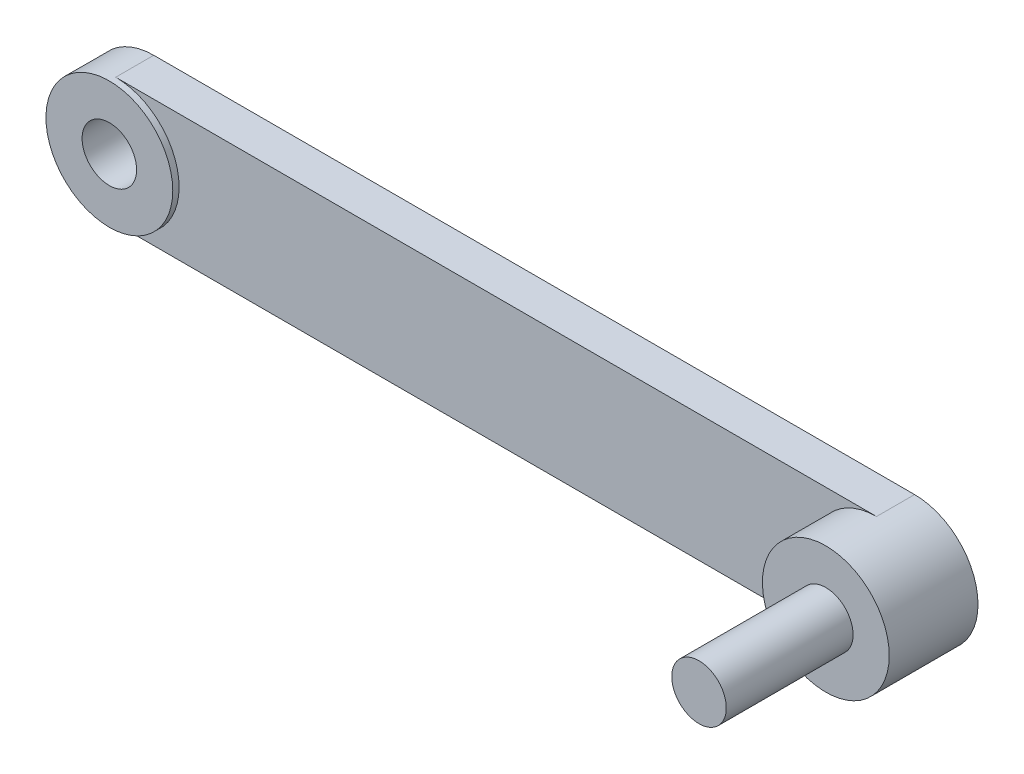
ISO-10303-21;
HEADER;
FILE_DESCRIPTION(('STEP AP214'),'2;1');
FILE_NAME('part.step','',(''),(''),'','','');
FILE_SCHEMA(('AUTOMOTIVE_DESIGN { 1 0 10303 214 1 1 1 1 }'));
ENDSEC;
DATA;
#1=APPLICATION_CONTEXT('core data for automotive mechanical design processes');
#2=APPLICATION_PROTOCOL_DEFINITION('international standard','automotive_design',2000,#1);
#3=PRODUCT_CONTEXT('',#1,'mechanical');
#4=PRODUCT('Part','Part','',(#3));
#5=PRODUCT_RELATED_PRODUCT_CATEGORY('part','',(#4));
#6=PRODUCT_DEFINITION_FORMATION('','',#4);
#7=PRODUCT_DEFINITION_CONTEXT('part definition',#1,'design');
#8=PRODUCT_DEFINITION('design','',#6,#7);
#9=PRODUCT_DEFINITION_SHAPE('','',#8);
#10=(LENGTH_UNIT() NAMED_UNIT(*) SI_UNIT(.MILLI.,.METRE.));
#11=(NAMED_UNIT(*) PLANE_ANGLE_UNIT() SI_UNIT($,.RADIAN.));
#12=(NAMED_UNIT(*) SI_UNIT($,.STERADIAN.) SOLID_ANGLE_UNIT());
#13=UNCERTAINTY_MEASURE_WITH_UNIT(LENGTH_MEASURE(1.E-05),#10,'distance_accuracy_value','');
#14=(GEOMETRIC_REPRESENTATION_CONTEXT(3) GLOBAL_UNCERTAINTY_ASSIGNED_CONTEXT((#13)) GLOBAL_UNIT_ASSIGNED_CONTEXT((#10,
#11,#12)) REPRESENTATION_CONTEXT('',''));
#15=CARTESIAN_POINT('',(0.,0.,0.));
#16=DIRECTION('',(0.,0.,1.));
#17=DIRECTION('',(1.,0.,0.));
#18=AXIS2_PLACEMENT_3D('',#15,#16,#17);
#19=CARTESIAN_POINT('',(0.,0.,3.));
#20=DIRECTION('',(0.,0.,1.));
#21=DIRECTION('',(1.,0.,0.));
#22=AXIS2_PLACEMENT_3D('',#19,#20,#21);
#23=PLANE('',#22);
#24=DIRECTION('',(1.,0.,0.));
#25=VECTOR('',#24,1.);
#26=CARTESIAN_POINT('',(0.,-5.,3.));
#27=LINE('',#26,#25);
#28=CARTESIAN_POINT('',(0.,-5.,3.));
#29=VERTEX_POINT('',#28);
#30=CARTESIAN_POINT('',(60.,-5.,3.));
#31=VERTEX_POINT('',#30);
#32=EDGE_CURVE('E52',#29,#31,#27,.T.);
#33=ORIENTED_EDGE('',*,*,#32,.T.);
#34=CARTESIAN_POINT('',(60.,0.,3.));
#35=DIRECTION('',(0.,0.,1.));
#36=DIRECTION('',(1.,0.,0.));
#37=AXIS2_PLACEMENT_3D('',#34,#35,#36);
#38=CIRCLE('',#37,5.);
#39=CARTESIAN_POINT('',(60.,5.,3.));
#40=VERTEX_POINT('',#39);
#41=EDGE_CURVE('E116',#40,#31,#38,.T.);
#42=ORIENTED_EDGE('',*,*,#41,.F.);
#43=DIRECTION('',(-1.,0.,0.));
#44=VECTOR('',#43,1.);
#45=CARTESIAN_POINT('',(0.,5.,3.));
#46=LINE('',#45,#44);
#47=CARTESIAN_POINT('',(0.,5.,3.));
#48=VERTEX_POINT('',#47);
#49=EDGE_CURVE('E91',#40,#48,#46,.T.);
#50=ORIENTED_EDGE('',*,*,#49,.T.);
#51=CARTESIAN_POINT('',(0.,0.,3.));
#52=DIRECTION('',(0.,0.,1.));
#53=DIRECTION('',(1.,0.,0.));
#54=AXIS2_PLACEMENT_3D('',#51,#52,#53);
#55=CIRCLE('',#54,5.);
#56=EDGE_CURVE('E44',#29,#48,#55,.T.);
#57=ORIENTED_EDGE('',*,*,#56,.F.);
#58=EDGE_LOOP('',(#33,#42,#50,#57));
#59=FACE_BOUND('',#58,.T.);
#60=ADVANCED_FACE('F35',(#59),#23,.T.);
#61=CARTESIAN_POINT('',(0.,0.,0.));
#62=DIRECTION('',(0.,0.,1.));
#63=DIRECTION('',(1.,0.,0.));
#64=AXIS2_PLACEMENT_3D('',#61,#62,#63);
#65=PLANE('',#64);
#66=CARTESIAN_POINT('',(0.,0.,0.));
#67=DIRECTION('',(0.,0.,1.));
#68=DIRECTION('',(1.,0.,0.));
#69=AXIS2_PLACEMENT_3D('',#66,#67,#68);
#70=CIRCLE('',#69,5.);
#71=CARTESIAN_POINT('',(0.,5.,0.));
#72=VERTEX_POINT('',#71);
#73=CARTESIAN_POINT('',(0.,-5.,0.));
#74=VERTEX_POINT('',#73);
#75=EDGE_CURVE('E90',#72,#74,#70,.T.);
#76=ORIENTED_EDGE('',*,*,#75,.F.);
#77=DIRECTION('',(-1.,0.,0.));
#78=VECTOR('',#77,1.);
#79=CARTESIAN_POINT('',(0.,5.,0.));
#80=LINE('',#79,#78);
#81=CARTESIAN_POINT('',(60.,5.,0.));
#82=VERTEX_POINT('',#81);
#83=EDGE_CURVE('E75',#82,#72,#80,.T.);
#84=ORIENTED_EDGE('',*,*,#83,.F.);
#85=CARTESIAN_POINT('',(60.,0.,0.));
#86=DIRECTION('',(0.,0.,1.));
#87=DIRECTION('',(1.,0.,0.));
#88=AXIS2_PLACEMENT_3D('',#85,#86,#87);
#89=CIRCLE('',#88,5.);
#90=CARTESIAN_POINT('',(60.,-5.,0.));
#91=VERTEX_POINT('',#90);
#92=EDGE_CURVE('E69',#91,#82,#89,.T.);
#93=ORIENTED_EDGE('',*,*,#92,.F.);
#94=DIRECTION('',(1.,0.,0.));
#95=VECTOR('',#94,1.);
#96=CARTESIAN_POINT('',(0.,-5.,0.));
#97=LINE('',#96,#95);
#98=EDGE_CURVE('E95',#74,#91,#97,.T.);
#99=ORIENTED_EDGE('',*,*,#98,.F.);
#100=EDGE_LOOP('',(#76,#84,#93,#99));
#101=FACE_BOUND('',#100,.T.);
#102=CARTESIAN_POINT('',(0.,0.,0.));
#103=DIRECTION('',(0.,0.,1.));
#104=DIRECTION('',(1.,0.,0.));
#105=AXIS2_PLACEMENT_3D('',#102,#103,#104);
#106=CIRCLE('',#105,2.15);
#107=CARTESIAN_POINT('',(2.15,0.,0.));
#108=VERTEX_POINT('',#107);
#109=EDGE_CURVE('E97',#108,#108,#106,.T.);
#110=ORIENTED_EDGE('',*,*,#109,.T.);
#111=EDGE_LOOP('',(#110));
#112=FACE_BOUND('',#111,.T.);
#113=ADVANCED_FACE('F93',(#101,#112),#65,.F.);
#114=CARTESIAN_POINT('',(0.,0.,3.));
#115=DIRECTION('',(0.,0.,-1.));
#116=DIRECTION('',(-1.,0.,0.));
#117=AXIS2_PLACEMENT_3D('',#114,#115,#116);
#118=CYLINDRICAL_SURFACE('',#117,5.);
#119=ORIENTED_EDGE('',*,*,#75,.T.);
#120=DIRECTION('',(0.,0.,-1.));
#121=VECTOR('',#120,1.);
#122=CARTESIAN_POINT('',(0.,-5.,3.));
#123=LINE('',#122,#121);
#124=EDGE_CURVE('E109',#29,#74,#123,.T.);
#125=ORIENTED_EDGE('',*,*,#124,.F.);
#126=ORIENTED_EDGE('',*,*,#56,.T.);
#127=DIRECTION('',(0.,0.,-1.));
#128=VECTOR('',#127,1.);
#129=CARTESIAN_POINT('',(0.,5.,3.));
#130=LINE('',#129,#128);
#131=EDGE_CURVE('E79',#48,#72,#130,.T.);
#132=ORIENTED_EDGE('',*,*,#131,.T.);
#133=EDGE_LOOP('',(#119,#125,#126,#132));
#134=FACE_BOUND('',#133,.T.);
#135=CARTESIAN_POINT('',(0.,0.,3.5));
#136=DIRECTION('',(0.,0.,1.));
#137=DIRECTION('',(1.,0.,0.));
#138=AXIS2_PLACEMENT_3D('',#135,#136,#137);
#139=CIRCLE('',#138,5.);
#140=CARTESIAN_POINT('',(5.,0.,3.5));
#141=VERTEX_POINT('',#140);
#142=EDGE_CURVE('E101',#141,#141,#139,.T.);
#143=ORIENTED_EDGE('',*,*,#142,.F.);
#144=EDGE_LOOP('',(#143));
#145=FACE_BOUND('',#144,.T.);
#146=ADVANCED_FACE('F37',(#134,#145),#118,.T.);
#147=CARTESIAN_POINT('',(0.,-5.,3.));
#148=DIRECTION('',(0.,1.,0.));
#149=DIRECTION('',(0.,0.,1.));
#150=AXIS2_PLACEMENT_3D('',#147,#148,#149);
#151=PLANE('',#150);
#152=ORIENTED_EDGE('',*,*,#98,.T.);
#153=DIRECTION('',(0.,0.,-1.));
#154=VECTOR('',#153,1.);
#155=CARTESIAN_POINT('',(60.,-5.,3.));
#156=LINE('',#155,#154);
#157=EDGE_CURVE('E108',#31,#91,#156,.T.);
#158=ORIENTED_EDGE('',*,*,#157,.F.);
#159=ORIENTED_EDGE('',*,*,#32,.F.);
#160=ORIENTED_EDGE('',*,*,#124,.T.);
#161=EDGE_LOOP('',(#152,#158,#159,#160));
#162=FACE_BOUND('',#161,.T.);
#163=ADVANCED_FACE('F159',(#162),#151,.F.);
#164=CARTESIAN_POINT('',(60.,0.,3.));
#165=DIRECTION('',(0.,0.,-1.));
#166=DIRECTION('',(-1.,0.,0.));
#167=AXIS2_PLACEMENT_3D('',#164,#165,#166);
#168=CYLINDRICAL_SURFACE('',#167,5.);
#169=ORIENTED_EDGE('',*,*,#92,.T.);
#170=DIRECTION('',(0.,0.,-1.));
#171=VECTOR('',#170,1.);
#172=CARTESIAN_POINT('',(60.,5.,3.));
#173=LINE('',#172,#171);
#174=EDGE_CURVE('E81',#40,#82,#173,.T.);
#175=ORIENTED_EDGE('',*,*,#174,.F.);
#176=ORIENTED_EDGE('',*,*,#41,.T.);
#177=ORIENTED_EDGE('',*,*,#157,.T.);
#178=EDGE_LOOP('',(#169,#175,#176,#177));
#179=FACE_BOUND('',#178,.T.);
#180=CARTESIAN_POINT('',(60.,0.,7.));
#181=DIRECTION('',(0.,0.,1.));
#182=DIRECTION('',(1.,0.,0.));
#183=AXIS2_PLACEMENT_3D('',#180,#181,#182);
#184=CIRCLE('',#183,5.);
#185=CARTESIAN_POINT('',(65.,0.,7.));
#186=VERTEX_POINT('',#185);
#187=EDGE_CURVE('E121',#186,#186,#184,.T.);
#188=ORIENTED_EDGE('',*,*,#187,.F.);
#189=EDGE_LOOP('',(#188));
#190=FACE_BOUND('',#189,.T.);
#191=ADVANCED_FACE('F118',(#179,#190),#168,.T.);
#192=CARTESIAN_POINT('',(0.,5.,3.));
#193=DIRECTION('',(0.,-1.,0.));
#194=DIRECTION('',(0.,0.,-1.));
#195=AXIS2_PLACEMENT_3D('',#192,#193,#194);
#196=PLANE('',#195);
#197=ORIENTED_EDGE('',*,*,#83,.T.);
#198=ORIENTED_EDGE('',*,*,#131,.F.);
#199=ORIENTED_EDGE('',*,*,#49,.F.);
#200=ORIENTED_EDGE('',*,*,#174,.T.);
#201=EDGE_LOOP('',(#197,#198,#199,#200));
#202=FACE_BOUND('',#201,.T.);
#203=ADVANCED_FACE('F77',(#202),#196,.F.);
#204=CARTESIAN_POINT('',(0.,0.,3.));
#205=DIRECTION('',(0.,0.,-1.));
#206=DIRECTION('',(-1.,0.,0.));
#207=AXIS2_PLACEMENT_3D('',#204,#205,#206);
#208=CYLINDRICAL_SURFACE('',#207,2.15);
#209=ORIENTED_EDGE('',*,*,#109,.F.);
#210=EDGE_LOOP('',(#209));
#211=FACE_BOUND('',#210,.T.);
#212=CARTESIAN_POINT('',(0.,0.,3.5));
#213=DIRECTION('',(0.,0.,1.));
#214=DIRECTION('',(1.,0.,0.));
#215=AXIS2_PLACEMENT_3D('',#212,#213,#214);
#216=CIRCLE('',#215,2.15);
#217=CARTESIAN_POINT('',(2.15,0.,3.5));
#218=VERTEX_POINT('',#217);
#219=EDGE_CURVE('E120',#218,#218,#216,.T.);
#220=ORIENTED_EDGE('',*,*,#219,.T.);
#221=EDGE_LOOP('',(#220));
#222=FACE_BOUND('',#221,.T.);
#223=ADVANCED_FACE('F153',(#211,#222),#208,.F.);
#224=CARTESIAN_POINT('',(0.,0.,3.5));
#225=DIRECTION('',(0.,0.,1.));
#226=DIRECTION('',(1.,0.,0.));
#227=AXIS2_PLACEMENT_3D('',#224,#225,#226);
#228=PLANE('',#227);
#229=ORIENTED_EDGE('',*,*,#142,.T.);
#230=EDGE_LOOP('',(#229));
#231=FACE_BOUND('',#230,.T.);
#232=ORIENTED_EDGE('',*,*,#219,.F.);
#233=EDGE_LOOP('',(#232));
#234=FACE_BOUND('',#233,.T.);
#235=ADVANCED_FACE('F143',(#231,#234),#228,.T.);
#236=CARTESIAN_POINT('',(60.,0.,7.));
#237=DIRECTION('',(0.,0.,1.));
#238=DIRECTION('',(1.,0.,0.));
#239=AXIS2_PLACEMENT_3D('',#236,#237,#238);
#240=PLANE('',#239);
#241=CARTESIAN_POINT('',(60.,0.,7.));
#242=DIRECTION('',(0.,0.,1.));
#243=DIRECTION('',(1.,0.,0.));
#244=AXIS2_PLACEMENT_3D('',#241,#242,#243);
#245=CIRCLE('',#244,2.15);
#246=CARTESIAN_POINT('',(62.15,0.,7.));
#247=VERTEX_POINT('',#246);
#248=EDGE_CURVE('E11',#247,#247,#245,.T.);
#249=ORIENTED_EDGE('',*,*,#248,.F.);
#250=EDGE_LOOP('',(#249));
#251=FACE_BOUND('',#250,.T.);
#252=ORIENTED_EDGE('',*,*,#187,.T.);
#253=EDGE_LOOP('',(#252));
#254=FACE_BOUND('',#253,.T.);
#255=ADVANCED_FACE('F135',(#251,#254),#240,.T.);
#256=CARTESIAN_POINT('',(60.,0.,17.));
#257=DIRECTION('',(0.,0.,-1.));
#258=DIRECTION('',(-1.,0.,0.));
#259=AXIS2_PLACEMENT_3D('',#256,#257,#258);
#260=PLANE('',#259);
#261=CARTESIAN_POINT('',(60.,0.,17.));
#262=DIRECTION('',(0.,0.,-1.));
#263=DIRECTION('',(-1.,0.,0.));
#264=AXIS2_PLACEMENT_3D('',#261,#262,#263);
#265=CIRCLE('',#264,2.15);
#266=CARTESIAN_POINT('',(57.85,0.,17.));
#267=VERTEX_POINT('',#266);
#268=EDGE_CURVE('E125',#267,#267,#265,.T.);
#269=ORIENTED_EDGE('',*,*,#268,.F.);
#270=EDGE_LOOP('',(#269));
#271=FACE_BOUND('',#270,.T.);
#272=ADVANCED_FACE('F133',(#271),#260,.F.);
#273=CARTESIAN_POINT('',(60.,0.,17.));
#274=DIRECTION('',(0.,0.,-1.));
#275=DIRECTION('',(-1.,0.,0.));
#276=AXIS2_PLACEMENT_3D('',#273,#274,#275);
#277=CYLINDRICAL_SURFACE('',#276,2.15);
#278=ORIENTED_EDGE('',*,*,#248,.T.);
#279=EDGE_LOOP('',(#278));
#280=FACE_BOUND('',#279,.T.);
#281=ORIENTED_EDGE('',*,*,#268,.T.);
#282=EDGE_LOOP('',(#281));
#283=FACE_BOUND('',#282,.T.);
#284=ADVANCED_FACE('F131',(#280,#283),#277,.T.);
#285=CLOSED_SHELL('',(#60,#113,#146,#163,#191,#203,#223,#235,#255,#272,#284));
#286=MANIFOLD_SOLID_BREP('B2',#285);
#287=ADVANCED_BREP_SHAPE_REPRESENTATION('',(#18,#286),#14);
#288=SHAPE_DEFINITION_REPRESENTATION(#9,#287);
ENDSEC;
END-ISO-10303-21;
